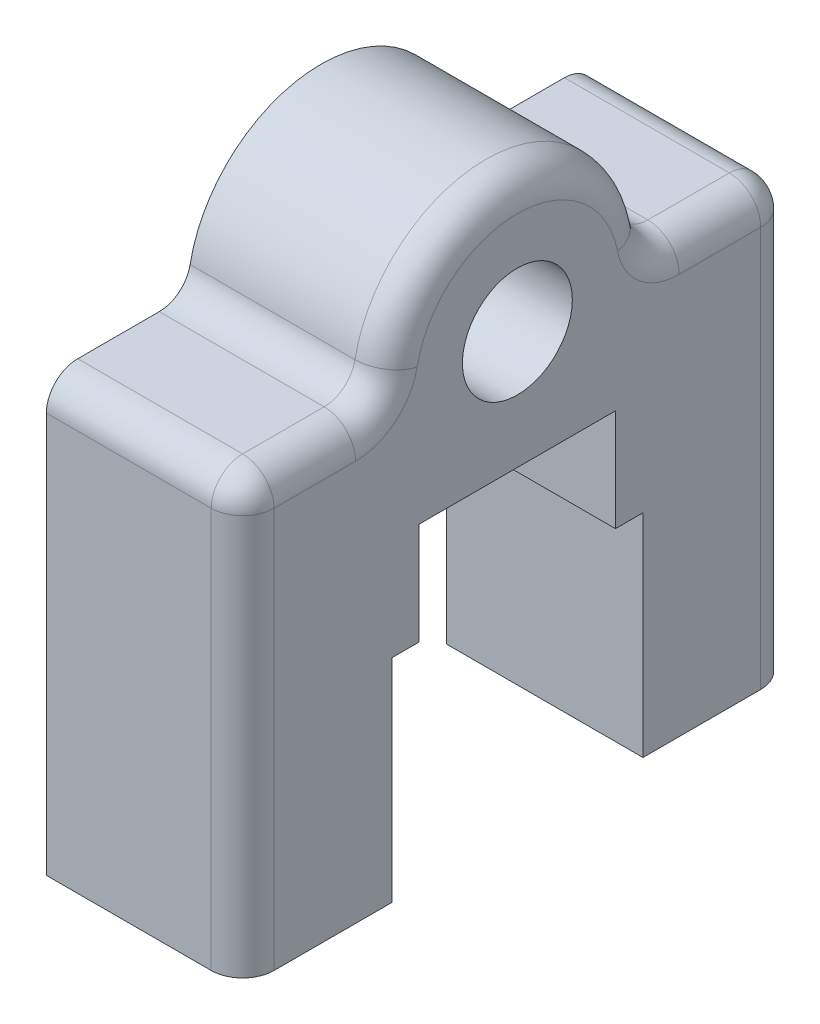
from build123d import *

# Parameters (mm, degrees)
SKETCH1_R           = 7
BOSS_EXTRUDE1_DEPTH = 25
CUT_EXTRUDE1_DEPTH  = 84.868945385
FILLET1_R           = 4
FILLET2_R           = 4


with BuildPart() as part:
    # Sketch1 → Boss-Extrude1 (new body)
    with BuildSketch(Plane(origin=(0, 0, 0), x_dir=(0, 0, -1), z_dir=(1, 0, 0))):
        with BuildLine():
            Line((17, 55), (35, 55))
            Line((35, 55), (35, 0))
            Line((35, 0), (-35, 0))
            Line((-35, 0), (-35, 55))
            Line((-35, 55), (-17, 55))
            ThreePointArc((-17, 55), (0, 72), (17, 55))
        make_face()
        with Locations((0, 55)):
            Circle(SKETCH1_R, mode=Mode.SUBTRACT)
    extrude(amount=BOSS_EXTRUDE1_DEPTH)

    # Sketch2 → Cut-Extrude1 (cut, through all)
    with BuildSketch(Plane(origin=(25, 0, 0), x_dir=(0, 0, -1), z_dir=(1, 0, 0))):
        Polygon((-16, 27), (-12.5, 27), (-12.5, 40), (12.5, 40), (12.5, 27), (16, 27), (16, 0), (-16, 0), align=None)
    extrude(amount=-CUT_EXTRUDE1_DEPTH, mode=Mode.SUBTRACT)

    # Fillet1
    fillet1_edges = [part.edges().sort_by_distance(p)[0] for p in [
        (12.5, 55, 35),
        (12.5, 55, 17),
        (12.5, 55, -17),
        (12.5, 55, -35),
    ]]
    fillet(fillet1_edges, radius=FILLET1_R)

    # Fillet2
    fillet2_edges = [part.edges().sort_by_distance(p)[0] for p in [
        (25, 25.5, -35),
        (25, 55, -25.807764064),
        (25, 72, 0),
        (25, 55, 25.807764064),
        (25, 25.5, 35),
        (25, 53.828427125, 33.828427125),
        (25, 53.828427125, -33.828427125),
        (25, 55.913933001, -18.070692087),
        (25, 55.913933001, 18.070692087),
    ]]
    fillet(fillet2_edges, radius=FILLET2_R)


solid = part.part
